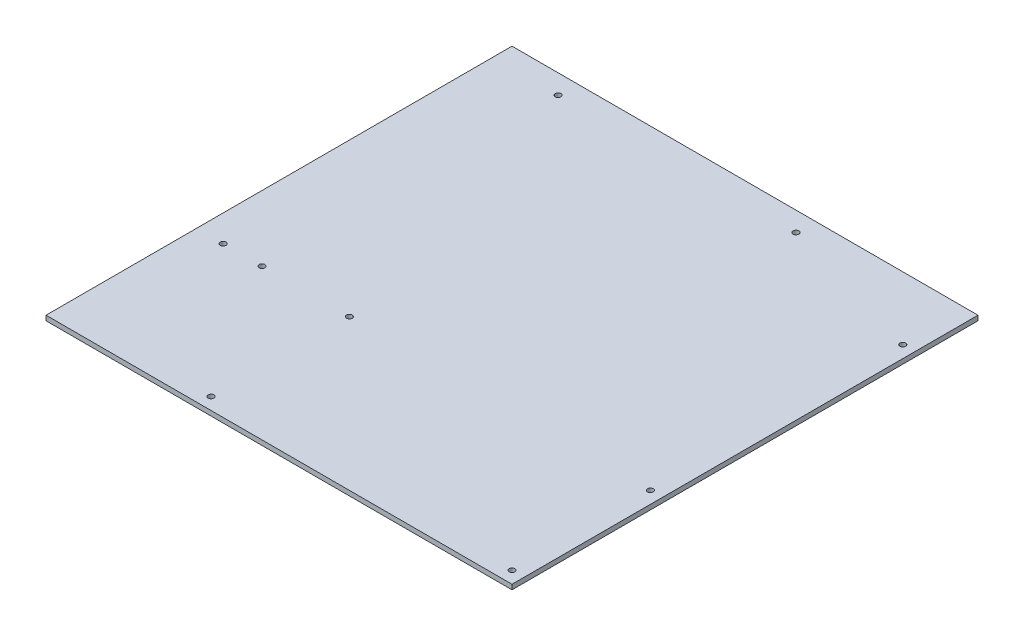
from build123d import *

# Parameters (mm, degrees)
SKETCH1_W                    = 243.84
SKETCH1_H                    = 243.84
EXTRUDE1_DEPTH               = 2.54
F_3_0_3_DIAMETER_HOLE1_D     = 3
F_3_0_3_DIAMETER_HOLE1_DEPTH = 3.048
F_3_0_3_DIAMETER_HOLE1_TIP   = 0.901290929


with BuildPart() as part:
    # Sketch1 → Extrude1 (new body)
    with BuildSketch(Plane(origin=(0, 0, 0), x_dir=(1, 0, 0), z_dir=(0, 1, 0))):
        with Locations((0, 121.92)):
            Rectangle(SKETCH1_W, SKETCH1_H)
    extrude(amount=EXTRUDE1_DEPTH)

    # 3.0 _3_ Diameter Hole1
    with Locations(Plane(origin=(0, 2.54, 0), x_dir=(1, 0, 0), z_dir=(0, 1, 0))):
        with Locations((-87.63, 233.68), (-41.91, 6.35), (36.83, 233.68), (115.57, 210.82), (-107.95, 78.74), (-87.63, 78.74), (-41.91, 78.74), (115.57, 6.35), (115.57, 78.74)):
            Hole(F_3_0_3_DIAMETER_HOLE1_D / 2, depth=F_3_0_3_DIAMETER_HOLE1_DEPTH)
            with Locations((0, 0, -(F_3_0_3_DIAMETER_HOLE1_DEPTH + F_3_0_3_DIAMETER_HOLE1_TIP / 2))):  # 118° drill point
                Cone(0, F_3_0_3_DIAMETER_HOLE1_D / 2, F_3_0_3_DIAMETER_HOLE1_TIP, mode=Mode.SUBTRACT)


solid = part.part
